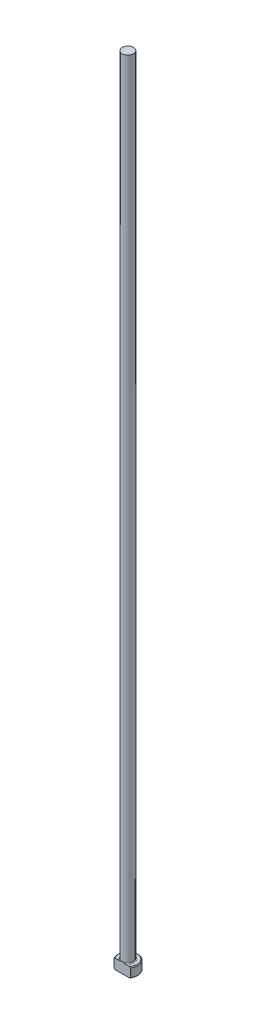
from build123d import *

# Parameters (mm, degrees)
CHAMFER1_SIZE = 0.254
FILLET1_R     = 0.254
KEY_DEPTH     = 255.0396844


with BuildPart() as part:
    # Sketch1 → Revolve1 (revolve)
    with BuildSketch(Plane.XY, mode=Mode.PRIVATE) as revolve1_sk:
        Polygon((0, 0), (-3.175, 0), (-3.175, 3.175), (-1.78562, 3.175), (-1.78562, 254), (0, 254), align=None)
    revolve(revolve1_sk.sketch.rotate(Axis((0, 259.958771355, 0), (0, -1, 0)), 270), axis=Axis((0, 259.958771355, 0), (0, -1, 0)))

    # Chamfer1
    chamfer1_edges = [part.edges().sort_by_distance(p)[0] for p in [
        (0, 3.175, -3.175),
        (0, 0, -3.175),
    ]]
    chamfer(chamfer1_edges, length=CHAMFER1_SIZE)

    # Fillet1
    fillet1_edges = [part.edges().sort_by_distance(p)[0] for p in [
        (0, 3.175, -1.78562),
    ]]
    fillet(fillet1_edges, radius=FILLET1_R)

    # Sketch2 → Key (cut, through all)
    with BuildSketch(Plane(origin=(0, 0, 0), x_dir=(1, 0, 0), z_dir=(0, 1, 0))):
        with BuildLine():
            Line((-2.625297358, -1.78562), (2.625297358, -1.78562))
            ThreePointArc((2.625297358, -1.78562), (0, -3.175), (-2.625297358, -1.78562))
        make_face()
    extrude(amount=KEY_DEPTH, mode=Mode.SUBTRACT)


solid = part.part
